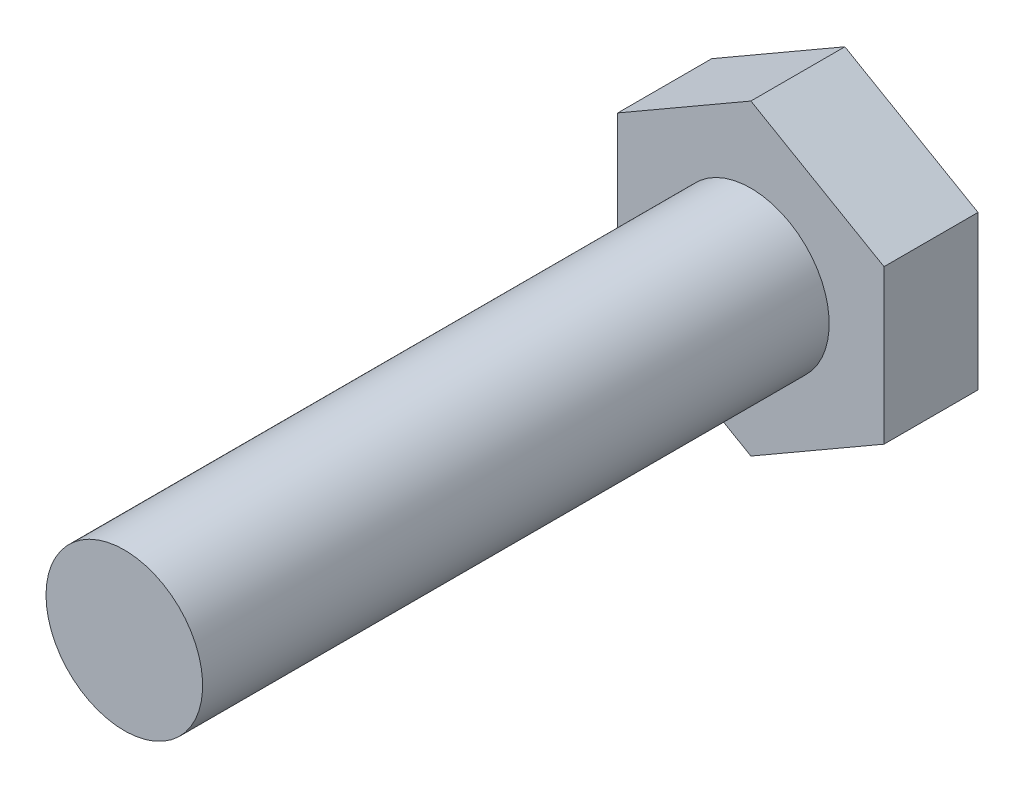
ISO-10303-21;
HEADER;
FILE_DESCRIPTION(('STEP AP214'),'2;1');
FILE_NAME('part.step','',(''),(''),'','','');
FILE_SCHEMA(('AUTOMOTIVE_DESIGN { 1 0 10303 214 1 1 1 1 }'));
ENDSEC;
DATA;
#1=APPLICATION_CONTEXT('core data for automotive mechanical design processes');
#2=APPLICATION_PROTOCOL_DEFINITION('international standard','automotive_design',2000,#1);
#3=PRODUCT_CONTEXT('',#1,'mechanical');
#4=PRODUCT('Part','Part','',(#3));
#5=PRODUCT_RELATED_PRODUCT_CATEGORY('part','',(#4));
#6=PRODUCT_DEFINITION_FORMATION('','',#4);
#7=PRODUCT_DEFINITION_CONTEXT('part definition',#1,'design');
#8=PRODUCT_DEFINITION('design','',#6,#7);
#9=PRODUCT_DEFINITION_SHAPE('','',#8);
#10=(LENGTH_UNIT() NAMED_UNIT(*) SI_UNIT(.MILLI.,.METRE.));
#11=(NAMED_UNIT(*) PLANE_ANGLE_UNIT() SI_UNIT($,.RADIAN.));
#12=(NAMED_UNIT(*) SI_UNIT($,.STERADIAN.) SOLID_ANGLE_UNIT());
#13=UNCERTAINTY_MEASURE_WITH_UNIT(LENGTH_MEASURE(1.E-05),#10,'distance_accuracy_value','');
#14=(GEOMETRIC_REPRESENTATION_CONTEXT(3) GLOBAL_UNCERTAINTY_ASSIGNED_CONTEXT((#13)) GLOBAL_UNIT_ASSIGNED_CONTEXT((#10,
#11,#12)) REPRESENTATION_CONTEXT('',''));
#15=CARTESIAN_POINT('',(0.,0.,0.));
#16=DIRECTION('',(0.,0.,1.));
#17=DIRECTION('',(1.,0.,0.));
#18=AXIS2_PLACEMENT_3D('',#15,#16,#17);
#19=CARTESIAN_POINT('',(0.,0.,47.5));
#20=DIRECTION('',(0.,0.,-1.));
#21=DIRECTION('',(-1.,0.,0.));
#22=AXIS2_PLACEMENT_3D('',#19,#20,#21);
#23=PLANE('',#22);
#24=CARTESIAN_POINT('',(0.,0.,47.5));
#25=DIRECTION('',(0.,0.,-1.));
#26=DIRECTION('',(-1.,0.,0.));
#27=AXIS2_PLACEMENT_3D('',#24,#25,#26);
#28=CIRCLE('',#27,5.);
#29=CARTESIAN_POINT('',(-5.,0.,47.5));
#30=VERTEX_POINT('',#29);
#31=EDGE_CURVE('E22',#30,#30,#28,.T.);
#32=ORIENTED_EDGE('',*,*,#31,.F.);
#33=EDGE_LOOP('',(#32));
#34=FACE_BOUND('',#33,.T.);
#35=ADVANCED_FACE('F15',(#34),#23,.F.);
#36=CARTESIAN_POINT('',(0.,0.,-22.5));
#37=DIRECTION('',(0.,0.,-1.));
#38=DIRECTION('',(-1.,0.,0.));
#39=AXIS2_PLACEMENT_3D('',#36,#37,#38);
#40=CYLINDRICAL_SURFACE('',#39,5.);
#41=CARTESIAN_POINT('',(0.,0.,7.5));
#42=DIRECTION('',(0.,0.,-1.));
#43=DIRECTION('',(-1.,0.,0.));
#44=AXIS2_PLACEMENT_3D('',#41,#42,#43);
#45=CIRCLE('',#44,5.);
#46=CARTESIAN_POINT('',(-5.,0.,7.5));
#47=VERTEX_POINT('',#46);
#48=EDGE_CURVE('E110',#47,#47,#45,.T.);
#49=ORIENTED_EDGE('',*,*,#48,.F.);
#50=EDGE_LOOP('',(#49));
#51=FACE_BOUND('',#50,.T.);
#52=ORIENTED_EDGE('',*,*,#31,.T.);
#53=EDGE_LOOP('',(#52));
#54=FACE_BOUND('',#53,.T.);
#55=ADVANCED_FACE('F115',(#51,#54),#40,.T.);
#56=CARTESIAN_POINT('',(-5.,0.,7.5));
#57=DIRECTION('',(0.,0.,-1.));
#58=DIRECTION('',(-1.,0.,0.));
#59=AXIS2_PLACEMENT_3D('',#56,#57,#58);
#60=PLANE('',#59);
#61=DIRECTION('',(0.866025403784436,-0.5,0.));
#62=VECTOR('',#61,1.);
#63=CARTESIAN_POINT('',(0.500000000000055,9.52627944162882,7.5));
#64=LINE('',#63,#62);
#65=CARTESIAN_POINT('',(0.,9.81495457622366,7.5));
#66=VERTEX_POINT('',#65);
#67=CARTESIAN_POINT('',(8.5,4.90747728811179,7.5));
#68=VERTEX_POINT('',#67);
#69=EDGE_CURVE('E81',#66,#68,#64,.T.);
#70=ORIENTED_EDGE('',*,*,#69,.F.);
#71=DIRECTION('',(-0.866025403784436,-0.5,0.));
#72=VECTOR('',#71,1.);
#73=CARTESIAN_POINT('',(-8.,5.1961524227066,7.5));
#74=LINE('',#73,#72);
#75=CARTESIAN_POINT('',(-8.5,4.90747728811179,7.5));
#76=VERTEX_POINT('',#75);
#77=EDGE_CURVE('E107',#66,#76,#74,.T.);
#78=ORIENTED_EDGE('',*,*,#77,.T.);
#79=DIRECTION('',(0.,-1.,0.));
#80=VECTOR('',#79,1.);
#81=CARTESIAN_POINT('',(-8.5,0.,7.5));
#82=LINE('',#81,#80);
#83=CARTESIAN_POINT('',(-8.5,-4.9074772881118,7.5));
#84=VERTEX_POINT('',#83);
#85=EDGE_CURVE('E104',#76,#84,#82,.T.);
#86=ORIENTED_EDGE('',*,*,#85,.T.);
#87=DIRECTION('',(-0.866025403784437,0.5,0.));
#88=VECTOR('',#87,1.);
#89=CARTESIAN_POINT('',(-8.,-5.19615242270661,7.5));
#90=LINE('',#89,#88);
#91=CARTESIAN_POINT('',(0.,-9.81495457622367,7.5));
#92=VERTEX_POINT('',#91);
#93=EDGE_CURVE('E102',#92,#84,#90,.T.);
#94=ORIENTED_EDGE('',*,*,#93,.F.);
#95=DIRECTION('',(0.866025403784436,0.5,0.));
#96=VECTOR('',#95,1.);
#97=CARTESIAN_POINT('',(0.50000000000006,-9.52627944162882,7.5));
#98=LINE('',#97,#96);
#99=CARTESIAN_POINT('',(8.5,-4.9074772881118,7.5));
#100=VERTEX_POINT('',#99);
#101=EDGE_CURVE('E99',#92,#100,#98,.T.);
#102=ORIENTED_EDGE('',*,*,#101,.T.);
#103=DIRECTION('',(0.,-1.,0.));
#104=VECTOR('',#103,1.);
#105=CARTESIAN_POINT('',(8.5,0.,7.5));
#106=LINE('',#105,#104);
#107=EDGE_CURVE('E97',#68,#100,#106,.T.);
#108=ORIENTED_EDGE('',*,*,#107,.F.);
#109=EDGE_LOOP('',(#70,#78,#86,#94,#102,#108));
#110=FACE_BOUND('',#109,.T.);
#111=ORIENTED_EDGE('',*,*,#48,.T.);
#112=EDGE_LOOP('',(#111));
#113=FACE_BOUND('',#112,.T.);
#114=ADVANCED_FACE('F122',(#110,#113),#60,.F.);
#115=CARTESIAN_POINT('',(0.,9.81495457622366,9.2));
#116=DIRECTION('',(0.5,-0.866025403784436,0.));
#117=DIRECTION('',(-0.866025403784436,-0.5,0.));
#118=AXIS2_PLACEMENT_3D('',#115,#116,#117);
#119=PLANE('',#118);
#120=DIRECTION('',(0.,0.,-1.));
#121=VECTOR('',#120,1.);
#122=CARTESIAN_POINT('',(0.,9.81495457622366,9.2));
#123=LINE('',#122,#121);
#124=CARTESIAN_POINT('',(0.,9.81495457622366,1.5));
#125=VERTEX_POINT('',#124);
#126=EDGE_CURVE('E35',#66,#125,#123,.T.);
#127=ORIENTED_EDGE('',*,*,#126,.T.);
#128=DIRECTION('',(-0.866025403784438,-0.5,0.));
#129=VECTOR('',#128,1.);
#130=CARTESIAN_POINT('',(0.,9.81495457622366,1.5));
#131=LINE('',#130,#129);
#132=CARTESIAN_POINT('',(-8.5,4.90747728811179,1.5));
#133=VERTEX_POINT('',#132);
#134=EDGE_CURVE('E28',#125,#133,#131,.T.);
#135=ORIENTED_EDGE('',*,*,#134,.T.);
#136=DIRECTION('',(0.,0.,-1.));
#137=VECTOR('',#136,1.);
#138=CARTESIAN_POINT('',(-8.5,4.90747728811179,9.2));
#139=LINE('',#138,#137);
#140=EDGE_CURVE('E93',#76,#133,#139,.T.);
#141=ORIENTED_EDGE('',*,*,#140,.F.);
#142=ORIENTED_EDGE('',*,*,#77,.F.);
#143=EDGE_LOOP('',(#127,#135,#141,#142));
#144=FACE_BOUND('',#143,.T.);
#145=ADVANCED_FACE('F127',(#144),#119,.F.);
#146=CARTESIAN_POINT('',(-8.5,4.90747728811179,9.2));
#147=DIRECTION('',(1.,0.,0.));
#148=DIRECTION('',(0.,-1.,0.));
#149=AXIS2_PLACEMENT_3D('',#146,#147,#148);
#150=PLANE('',#149);
#151=ORIENTED_EDGE('',*,*,#140,.T.);
#152=DIRECTION('',(0.,-1.,0.));
#153=VECTOR('',#152,1.);
#154=CARTESIAN_POINT('',(-8.5,4.90747728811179,1.5));
#155=LINE('',#154,#153);
#156=CARTESIAN_POINT('',(-8.5,-4.90747728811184,1.5));
#157=VERTEX_POINT('',#156);
#158=EDGE_CURVE('E174',#133,#157,#155,.T.);
#159=ORIENTED_EDGE('',*,*,#158,.T.);
#160=DIRECTION('',(0.,0.,-1.));
#161=VECTOR('',#160,1.);
#162=CARTESIAN_POINT('',(-8.5,-4.9074772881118,9.2));
#163=LINE('',#162,#161);
#164=EDGE_CURVE('E90',#84,#157,#163,.T.);
#165=ORIENTED_EDGE('',*,*,#164,.F.);
#166=ORIENTED_EDGE('',*,*,#85,.F.);
#167=EDGE_LOOP('',(#151,#159,#165,#166));
#168=FACE_BOUND('',#167,.T.);
#169=ADVANCED_FACE('F132',(#168),#150,.F.);
#170=CARTESIAN_POINT('',(0.,-9.81495457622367,9.2));
#171=DIRECTION('',(-0.5,-0.866025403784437,0.));
#172=DIRECTION('',(-0.866025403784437,0.5,0.));
#173=AXIS2_PLACEMENT_3D('',#170,#171,#172);
#174=PLANE('',#173);
#175=DIRECTION('',(-0.866025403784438,0.5,0.));
#176=VECTOR('',#175,1.);
#177=CARTESIAN_POINT('',(0.,-9.81495457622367,1.5));
#178=LINE('',#177,#176);
#179=CARTESIAN_POINT('',(0.,-9.81495457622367,1.5));
#180=VERTEX_POINT('',#179);
#181=EDGE_CURVE('E172',#180,#157,#178,.T.);
#182=ORIENTED_EDGE('',*,*,#181,.F.);
#183=DIRECTION('',(0.,0.,-1.));
#184=VECTOR('',#183,1.);
#185=CARTESIAN_POINT('',(0.,-9.81495457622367,9.2));
#186=LINE('',#185,#184);
#187=EDGE_CURVE('E83',#92,#180,#186,.T.);
#188=ORIENTED_EDGE('',*,*,#187,.F.);
#189=ORIENTED_EDGE('',*,*,#93,.T.);
#190=ORIENTED_EDGE('',*,*,#164,.T.);
#191=EDGE_LOOP('',(#182,#188,#189,#190));
#192=FACE_BOUND('',#191,.T.);
#193=ADVANCED_FACE('F135',(#192),#174,.T.);
#194=CARTESIAN_POINT('',(0.,-9.81495457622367,9.2));
#195=DIRECTION('',(-0.5,0.866025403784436,0.));
#196=DIRECTION('',(0.866025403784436,0.5,0.));
#197=AXIS2_PLACEMENT_3D('',#194,#195,#196);
#198=PLANE('',#197);
#199=ORIENTED_EDGE('',*,*,#187,.T.);
#200=DIRECTION('',(0.866025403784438,0.5,0.));
#201=VECTOR('',#200,1.);
#202=CARTESIAN_POINT('',(0.,-9.81495457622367,1.5));
#203=LINE('',#202,#201);
#204=CARTESIAN_POINT('',(8.5,-4.9074772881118,1.5));
#205=VERTEX_POINT('',#204);
#206=EDGE_CURVE('E76',#180,#205,#203,.T.);
#207=ORIENTED_EDGE('',*,*,#206,.T.);
#208=DIRECTION('',(0.,0.,-1.));
#209=VECTOR('',#208,1.);
#210=CARTESIAN_POINT('',(8.5,-4.9074772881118,9.2));
#211=LINE('',#210,#209);
#212=EDGE_CURVE('E75',#100,#205,#211,.T.);
#213=ORIENTED_EDGE('',*,*,#212,.F.);
#214=ORIENTED_EDGE('',*,*,#101,.F.);
#215=EDGE_LOOP('',(#199,#207,#213,#214));
#216=FACE_BOUND('',#215,.T.);
#217=ADVANCED_FACE('F139',(#216),#198,.F.);
#218=CARTESIAN_POINT('',(8.5,4.90747728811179,9.2));
#219=DIRECTION('',(1.,0.,0.));
#220=DIRECTION('',(0.,-1.,0.));
#221=AXIS2_PLACEMENT_3D('',#218,#219,#220);
#222=PLANE('',#221);
#223=DIRECTION('',(0.,-1.,0.));
#224=VECTOR('',#223,1.);
#225=CARTESIAN_POINT('',(8.5,4.90747728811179,1.5));
#226=LINE('',#225,#224);
#227=CARTESIAN_POINT('',(8.5,4.90747728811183,1.5));
#228=VERTEX_POINT('',#227);
#229=EDGE_CURVE('E65',#228,#205,#226,.T.);
#230=ORIENTED_EDGE('',*,*,#229,.F.);
#231=DIRECTION('',(0.,0.,-1.));
#232=VECTOR('',#231,1.);
#233=CARTESIAN_POINT('',(8.5,4.90747728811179,9.2));
#234=LINE('',#233,#232);
#235=EDGE_CURVE('E72',#68,#228,#234,.T.);
#236=ORIENTED_EDGE('',*,*,#235,.F.);
#237=ORIENTED_EDGE('',*,*,#107,.T.);
#238=ORIENTED_EDGE('',*,*,#212,.T.);
#239=EDGE_LOOP('',(#230,#236,#237,#238));
#240=FACE_BOUND('',#239,.T.);
#241=ADVANCED_FACE('F71',(#240),#222,.T.);
#242=CARTESIAN_POINT('',(0.,9.81495457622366,9.2));
#243=DIRECTION('',(0.5,0.866025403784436,0.));
#244=DIRECTION('',(0.866025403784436,-0.5,0.));
#245=AXIS2_PLACEMENT_3D('',#242,#243,#244);
#246=PLANE('',#245);
#247=DIRECTION('',(0.866025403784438,-0.5,0.));
#248=VECTOR('',#247,1.);
#249=CARTESIAN_POINT('',(0.,9.81495457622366,1.5));
#250=LINE('',#249,#248);
#251=EDGE_CURVE('E9',#125,#228,#250,.T.);
#252=ORIENTED_EDGE('',*,*,#251,.F.);
#253=ORIENTED_EDGE('',*,*,#126,.F.);
#254=ORIENTED_EDGE('',*,*,#69,.T.);
#255=ORIENTED_EDGE('',*,*,#235,.T.);
#256=EDGE_LOOP('',(#252,#253,#254,#255));
#257=FACE_BOUND('',#256,.T.);
#258=ADVANCED_FACE('F79',(#257),#246,.T.);
#259=CARTESIAN_POINT('',(0.,12.4450417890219,1.5));
#260=DIRECTION('',(0.,0.,1.));
#261=DIRECTION('',(1.,0.,0.));
#262=AXIS2_PLACEMENT_3D('',#259,#260,#261);
#263=PLANE('',#262);
#264=CARTESIAN_POINT('',(0.,0.,1.5));
#265=DIRECTION('',(0.,0.,1.));
#266=DIRECTION('',(1.,0.,0.));
#267=AXIS2_PLACEMENT_3D('',#264,#265,#266);
#268=CIRCLE('',#267,6.22252089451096);
#269=CARTESIAN_POINT('',(6.22252089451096,0.,1.5));
#270=VERTEX_POINT('',#269);
#271=EDGE_CURVE('E77',#270,#270,#268,.T.);
#272=ORIENTED_EDGE('',*,*,#271,.T.);
#273=EDGE_LOOP('',(#272));
#274=FACE_BOUND('',#273,.T.);
#275=ORIENTED_EDGE('',*,*,#251,.T.);
#276=ORIENTED_EDGE('',*,*,#229,.T.);
#277=ORIENTED_EDGE('',*,*,#206,.F.);
#278=ORIENTED_EDGE('',*,*,#181,.T.);
#279=ORIENTED_EDGE('',*,*,#158,.F.);
#280=ORIENTED_EDGE('',*,*,#134,.F.);
#281=EDGE_LOOP('',(#275,#276,#277,#278,#279,#280));
#282=FACE_BOUND('',#281,.T.);
#283=ADVANCED_FACE('F64',(#274,#282),#263,.F.);
#284=CARTESIAN_POINT('',(0.,0.,47.5));
#285=DIRECTION('',(0.,0.,1.));
#286=DIRECTION('',(1.,0.,0.));
#287=AXIS2_PLACEMENT_3D('',#284,#285,#286);
#288=CYLINDRICAL_SURFACE('',#287,6.22252089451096);
#289=ORIENTED_EDGE('',*,*,#271,.F.);
#290=EDGE_LOOP('',(#289));
#291=FACE_BOUND('',#290,.T.);
#292=CARTESIAN_POINT('',(0.,0.,0.));
#293=DIRECTION('',(0.,0.,1.));
#294=DIRECTION('',(1.,0.,0.));
#295=AXIS2_PLACEMENT_3D('',#292,#293,#294);
#296=CIRCLE('',#295,6.22252089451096);
#297=CARTESIAN_POINT('',(6.22252089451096,0.,0.));
#298=VERTEX_POINT('',#297);
#299=EDGE_CURVE('E165',#298,#298,#296,.T.);
#300=ORIENTED_EDGE('',*,*,#299,.T.);
#301=EDGE_LOOP('',(#300));
#302=FACE_BOUND('',#301,.T.);
#303=ADVANCED_FACE('F153',(#291,#302),#288,.T.);
#304=CARTESIAN_POINT('',(0.,6.22252089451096,0.));
#305=DIRECTION('',(0.,0.,1.));
#306=DIRECTION('',(1.,0.,0.));
#307=AXIS2_PLACEMENT_3D('',#304,#305,#306);
#308=PLANE('',#307);
#309=ORIENTED_EDGE('',*,*,#299,.F.);
#310=EDGE_LOOP('',(#309));
#311=FACE_BOUND('',#310,.T.);
#312=ADVANCED_FACE('F157',(#311),#308,.F.);
#313=CLOSED_SHELL('',(#35,#55,#114,#145,#169,#193,#217,#241,#258,#283,#303,#312));
#314=MANIFOLD_SOLID_BREP('B1',#313);
#315=ADVANCED_BREP_SHAPE_REPRESENTATION('',(#18,#314),#14);
#316=SHAPE_DEFINITION_REPRESENTATION(#9,#315);
ENDSEC;
END-ISO-10303-21;
